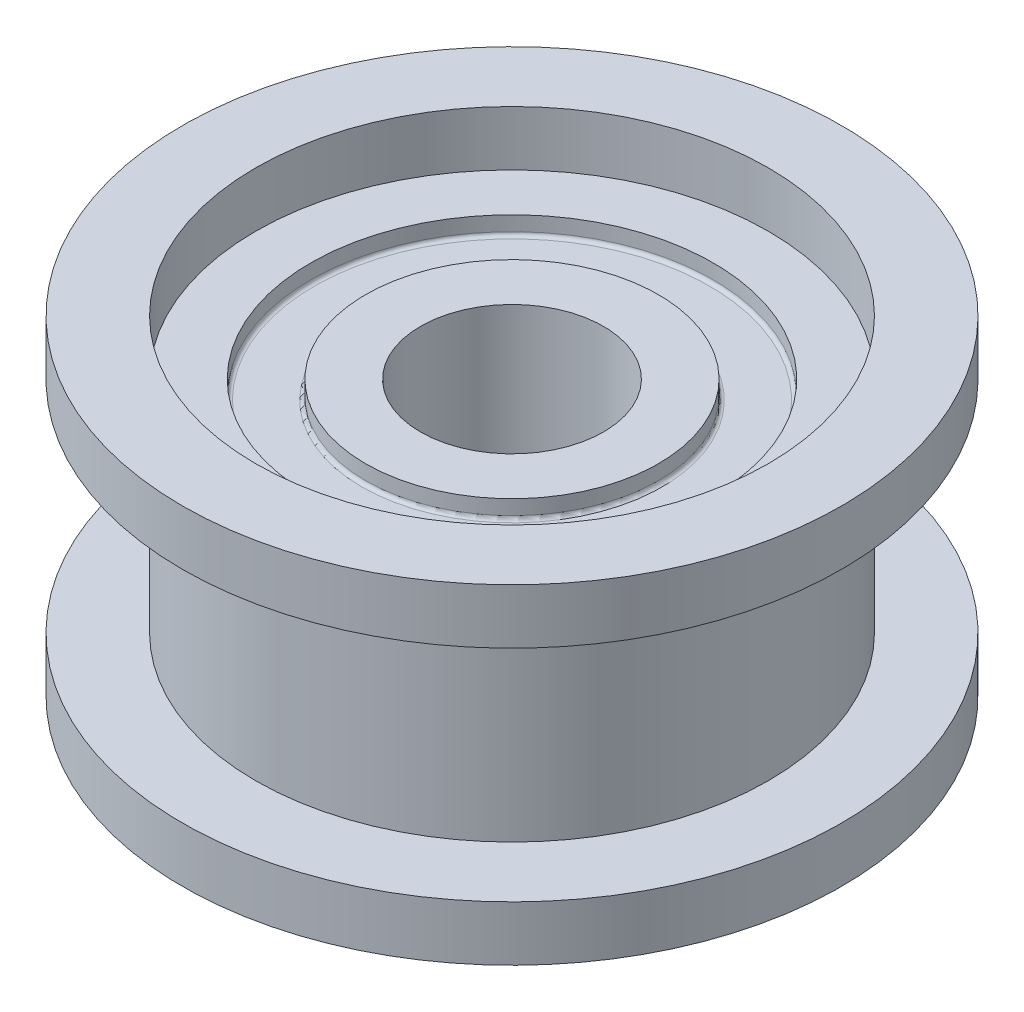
from build123d import *

# Parameters (mm, degrees)
SCHIZZO1_R                   = 7
SCHIZZO1_R_2                 = 2.5
ESTRUSIONE_ESTRUSIONE1_DEPTH = 6
SCHIZZO2_R                   = 5.5
SCHIZZO2_R_2                 = 4
TAGLIO_ESTRUSIONE1_DEPTH     = 0.5
TAGLIO_ESTRUSIONE2_START     = -0.5
SCHIZZO3_R                   = 5.5
SCHIZZO3_R_2                 = 4
TAGLIO_ESTRUSIONE2_DEPTH     = 0.5
RACCORDO1_R                  = 0.1
SCHIZZO4_R                   = 9
SCHIZZO4_R_2                 = 5.5
ESTRUSIONE_ESTRUSIONE2_DEPTH = 1.5
SCHIZZO5_R                   = 9
SCHIZZO5_R_2                 = 7
ESTRUSIONE_ESTRUSIONE3_DEPTH = 1.5


with BuildPart() as part:
    # Schizzo1 → Estrusione-Estrusione1 (new body)
    with BuildSketch(Plane(origin=(0, 0, 0), x_dir=(1, 0, 0), z_dir=(0, 1, 0))):
        with Locations(Location((0, 0, 0), (0, 0, 270))):
            Circle(SCHIZZO1_R)
        with Locations(Location((0, 0, 0), (0, 0, 270))):
            Circle(SCHIZZO1_R_2, mode=Mode.SUBTRACT)
    extrude(amount=ESTRUSIONE_ESTRUSIONE1_DEPTH)

    # Schizzo2 → Taglio-Estrusione1 (cut)
    with BuildSketch(Plane(origin=(0, 6, 0), x_dir=(1, 0, 0), z_dir=(0, 1, 0))):
        with Locations(Location((0, 0, 0), (0, 0, 270))):
            Circle(SCHIZZO2_R)
        with Locations(Location((0, 0, 0), (0, 0, 270))):
            Circle(SCHIZZO2_R_2, mode=Mode.SUBTRACT)
    extrude(amount=-TAGLIO_ESTRUSIONE1_DEPTH, mode=Mode.SUBTRACT)

    # Schizzo3 → Taglio-Estrusione2 (cut)
    with BuildSketch(Plane.XZ.offset(TAGLIO_ESTRUSIONE2_START)):
        with Locations(Location((0, 0, 0), (0, 0, 90))):
            Circle(SCHIZZO3_R)
        with Locations(Location((0, 0, 0), (0, 0, 90))):
            Circle(SCHIZZO3_R_2, mode=Mode.SUBTRACT)
    extrude(amount=TAGLIO_ESTRUSIONE2_DEPTH, mode=Mode.SUBTRACT)

    # Raccordo1
    raccordo1_edges = [part.edges().sort_by_distance(p)[0] for p in [
        (0, 5.5, -5.5),
        (0, 5.5, -4),
        (0, 0.5, -5.5),
        (0, 0.5, -4),
    ]]
    fillet(raccordo1_edges, radius=RACCORDO1_R)

    # Schizzo4 → Estrusione-Estrusione2 (add)
    with BuildSketch(Plane.XZ):
        with Locations(Location((0, 0, 0), (0, 0, 270))):
            Circle(SCHIZZO4_R)
        with Locations(Location((0, 0, 0), (0, 0, 90))):
            Circle(SCHIZZO4_R_2, mode=Mode.SUBTRACT)
    extrude(amount=ESTRUSIONE_ESTRUSIONE2_DEPTH)


with BuildPart() as body_2:
    # Schizzo5 → Estrusione-Estrusione3 (new body)
    with BuildSketch(Plane(origin=(0, 6, 0), x_dir=(1, 0, 0), z_dir=(0, 1, 0))):
        with Locations(Location((0, 0, 0), (0, 0, 270))):
            Circle(SCHIZZO5_R)
        with Locations(Location((0, 0, 0), (0, 0, 270))):
            Circle(SCHIZZO5_R_2, mode=Mode.SUBTRACT)
    extrude(amount=ESTRUSIONE_ESTRUSIONE3_DEPTH)


solid = Compound([part.part, body_2.part])
